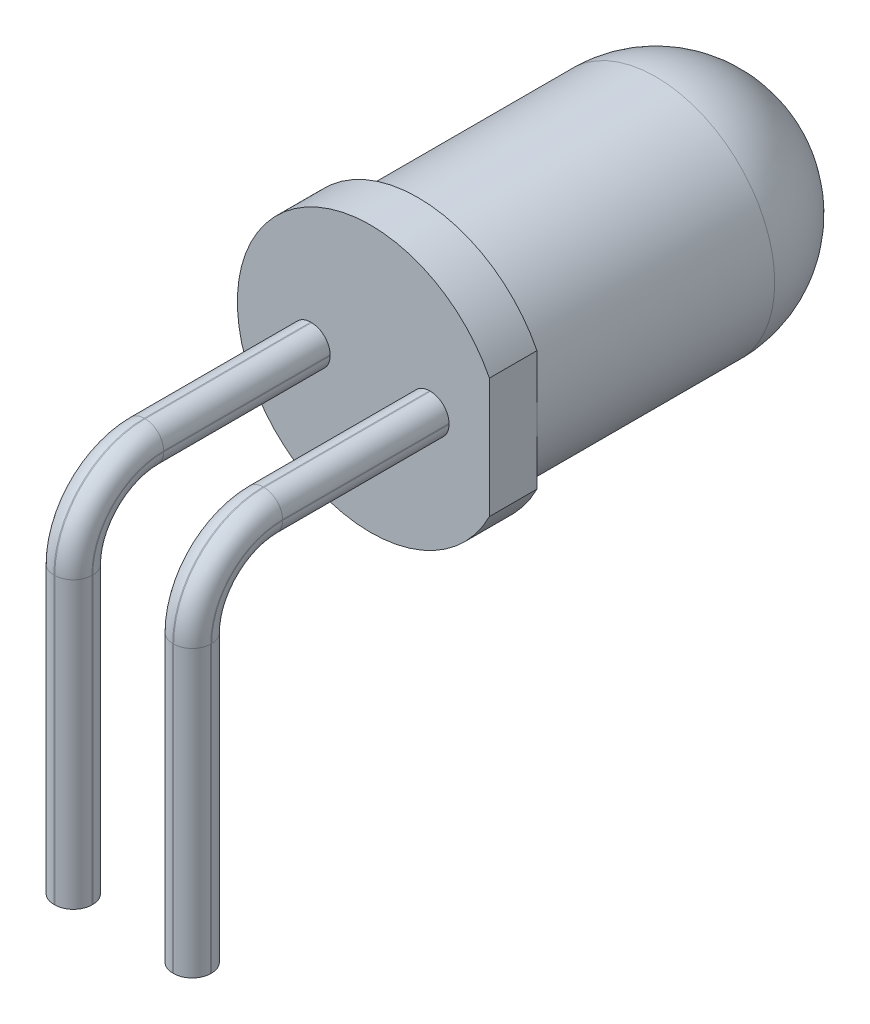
from build123d import *

# Parameters (mm, degrees)
ESQUISSE1_R             = 2.5
BASE_EXTRUSION_DEPTH    = 8.5
BOSS_EXTRU_1_DEPTH      = 1
CONG_1_R                = 2.5
BOSS_EXTRU_2_DEPTH      = 1.65
ESQUISSE5_W             = 1.7
ESQUISSE5_H             = 17.823982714
ENL_V_MAT_EXTRU_1_DEPTH = 10
CONG_3_R                = 0.39


with BuildPart() as part:
    # Esquisse1 → Base-Extrusion (new body)
    with BuildSketch(Plane.XY):
        Circle(ESQUISSE1_R)
    extrude(amount=BASE_EXTRUSION_DEPTH)

    # Esquisse2 → Boss.-Extru.1 (add)
    with BuildSketch(Plane.XY.offset(8.5)):
        with BuildLine():
            Line((2.5, 1.260952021), (2.5, -1.260952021))
            ThreePointArc((2.5, -1.260952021), (-2.8, 0), (2.5, 1.260952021))
        make_face()
    extrude(amount=-BOSS_EXTRU_1_DEPTH)

    # Cong_1
    cong_1_edges = [part.edges().sort_by_distance(p)[0] for p in [
        (-2.5, 0, 0),
    ]]
    fillet(cong_1_edges, radius=CONG_1_R)

    # Esquisse4 → Boss.-Extru.2 (add, symmetric)
    with BuildSketch(Plane(origin=(0, 0, 0), x_dir=(0, 0, -1), z_dir=(1, 0, 0))):
        with BuildLine():
            Line((-13.099990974, -1.504349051), (-13.099990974, -7.504349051))
            Line((-13.099990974, -7.504349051), (-13.89999737, -7.504349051))
            Line((-13.89999737, -7.504349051), (-13.89999737, -1.502891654))
            ThreePointArc((-13.89999737, -1.502891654), (-13.344524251, -0.157519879), (-11.99999936, 0.4))
            Line((-11.99999936, 0.4), (-8.454479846, 0.4))
            Line((-8.454479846, 0.4), (-8.454479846, -0.4))
            Line((-8.454479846, -0.4), (-11.99999936, -0.4))
            ThreePointArc((-11.99999936, -0.4), (-12.779352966, -0.723721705), (-13.099990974, -1.504349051))
        make_face()
    extrude(amount=BOSS_EXTRU_2_DEPTH, both=True)

    # Esquisse5 → Enl_v. mat.-Extru.1 (cut)
    with BuildSketch(Plane.XY.offset(8.5)):
        with Locations((0, -8.28809112)):
            Rectangle(ESQUISSE5_W, ESQUISSE5_H)
    extrude(amount=ENL_V_MAT_EXTRU_1_DEPTH, mode=Mode.SUBTRACT)

    # Cong_3
    cong_3_edges = [part.edges().sort_by_distance(p)[0] for p in [
        (-1.65, -0.723721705, 12.779352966),
        (-1.65, -0.4, 10.24999968),
        (-1.65, 0.4, 10.24999968),
        (-1.65, -0.157519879, 13.344524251),
        (-1.65, -4.503620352, 13.89999737),
        (-1.65, -4.504349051, 13.099990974),
        (1.65, -0.4, 10.24999968),
        (1.65, 0.4, 10.24999968),
        (1.65, -0.157519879, 13.344524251),
        (1.65, -4.503620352, 13.89999737),
        (1.65, -4.504349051, 13.099990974),
        (1.65, -0.723721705, 12.779352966),
        (0.85, -4.504349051, 13.099990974),
        (-0.85, -4.504349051, 13.099990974),
        (-0.85, -0.723721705, 12.779352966),
        (-0.85, -0.4, 10.24999968),
        (-0.85, 0.4, 10.24999968),
        (-0.85, -0.157519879, 13.344524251),
        (-0.85, -4.503620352, 13.89999737),
        (0.85, -0.4, 10.24999968),
        (0.85, -0.723721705, 12.779352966),
        (0.85, -4.503620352, 13.89999737),
        (0.85, -0.157519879, 13.344524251),
        (0.85, 0.4, 10.24999968),
    ]]
    fillet(cong_3_edges, radius=CONG_3_R)


solid = part.part
